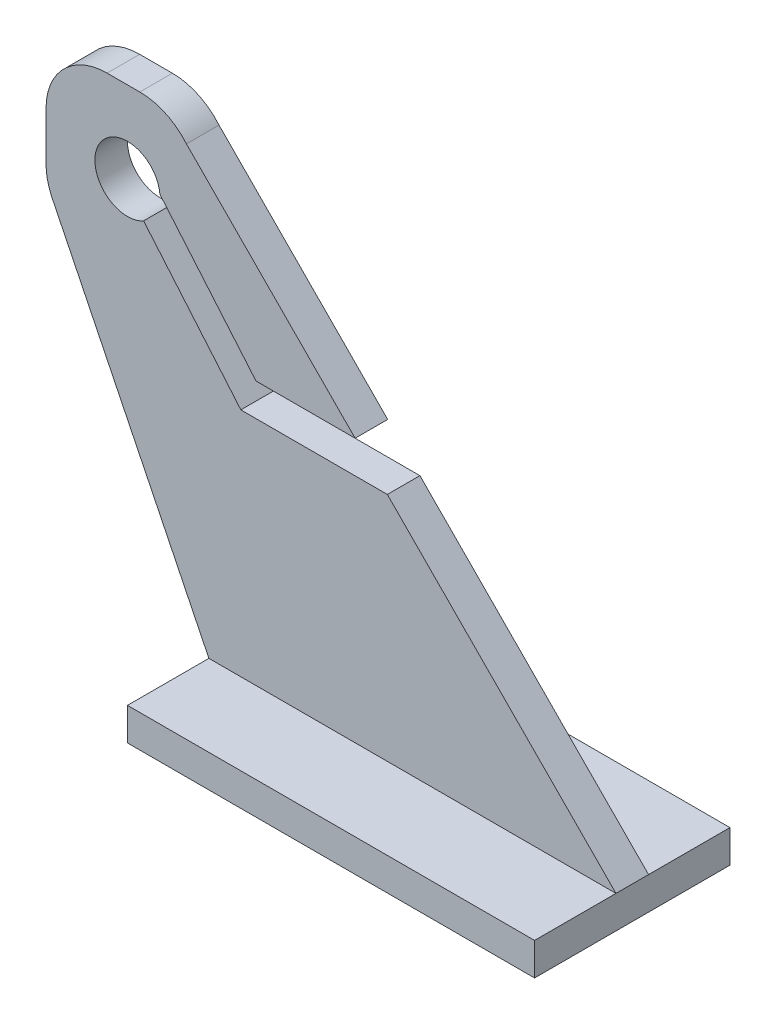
ISO-10303-21;
HEADER;
FILE_DESCRIPTION(('STEP AP214'),'2;1');
FILE_NAME('part.step','',(''),(''),'','','');
FILE_SCHEMA(('AUTOMOTIVE_DESIGN { 1 0 10303 214 1 1 1 1 }'));
ENDSEC;
DATA;
#1=APPLICATION_CONTEXT('core data for automotive mechanical design processes');
#2=APPLICATION_PROTOCOL_DEFINITION('international standard','automotive_design',2000,#1);
#3=PRODUCT_CONTEXT('',#1,'mechanical');
#4=PRODUCT('Part','Part','',(#3));
#5=PRODUCT_RELATED_PRODUCT_CATEGORY('part','',(#4));
#6=PRODUCT_DEFINITION_FORMATION('','',#4);
#7=PRODUCT_DEFINITION_CONTEXT('part definition',#1,'design');
#8=PRODUCT_DEFINITION('design','',#6,#7);
#9=PRODUCT_DEFINITION_SHAPE('','',#8);
#10=(LENGTH_UNIT() NAMED_UNIT(*) SI_UNIT(.MILLI.,.METRE.));
#11=(NAMED_UNIT(*) PLANE_ANGLE_UNIT() SI_UNIT($,.RADIAN.));
#12=(NAMED_UNIT(*) SI_UNIT($,.STERADIAN.) SOLID_ANGLE_UNIT());
#13=UNCERTAINTY_MEASURE_WITH_UNIT(LENGTH_MEASURE(1.E-05),#10,'distance_accuracy_value','');
#14=(GEOMETRIC_REPRESENTATION_CONTEXT(3) GLOBAL_UNCERTAINTY_ASSIGNED_CONTEXT((#13)) GLOBAL_UNIT_ASSIGNED_CONTEXT((#10,
#11,#12)) REPRESENTATION_CONTEXT('',''));
#15=CARTESIAN_POINT('',(0.,0.,0.));
#16=DIRECTION('',(0.,0.,1.));
#17=DIRECTION('',(1.,0.,0.));
#18=AXIS2_PLACEMENT_3D('',#15,#16,#17);
#19=CARTESIAN_POINT('',(4.44941706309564,11.4681898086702,0.8));
#20=DIRECTION('',(-0.71101506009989,-0.703176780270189,0.));
#21=DIRECTION('',(0.703176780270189,-0.71101506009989,0.));
#22=AXIS2_PLACEMENT_3D('',#19,#20,#21);
#23=PLANE('',#22);
#24=DIRECTION('',(-0.703176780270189,0.71101506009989,0.));
#25=VECTOR('',#24,1.);
#26=CARTESIAN_POINT('',(4.44941706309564,11.4681898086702,0.8));
#27=LINE('',#26,#25);
#28=CARTESIAN_POINT('',(8.59261820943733,7.27880458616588,0.8));
#29=VERTEX_POINT('',#28);
#30=CARTESIAN_POINT('',(4.44941706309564,11.4681898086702,0.8));
#31=VERTEX_POINT('',#30);
#32=EDGE_CURVE('E272',#29,#31,#27,.T.);
#33=ORIENTED_EDGE('',*,*,#32,.F.);
#34=DIRECTION('',(0.,0.,-1.));
#35=VECTOR('',#34,1.);
#36=CARTESIAN_POINT('',(8.59261820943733,7.27880458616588,0.8));
#37=LINE('',#36,#35);
#38=CARTESIAN_POINT('',(8.59261820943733,7.27880458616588,0.));
#39=VERTEX_POINT('',#38);
#40=EDGE_CURVE('E11',#29,#39,#37,.T.);
#41=ORIENTED_EDGE('',*,*,#40,.T.);
#42=DIRECTION('',(-0.703176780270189,0.71101506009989,0.));
#43=VECTOR('',#42,1.);
#44=CARTESIAN_POINT('',(4.44941706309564,11.4681898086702,0.));
#45=LINE('',#44,#43);
#46=CARTESIAN_POINT('',(4.44941706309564,11.4681898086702,0.));
#47=VERTEX_POINT('',#46);
#48=EDGE_CURVE('E295',#39,#47,#45,.T.);
#49=ORIENTED_EDGE('',*,*,#48,.T.);
#50=DIRECTION('',(0.,0.,-1.));
#51=VECTOR('',#50,1.);
#52=CARTESIAN_POINT('',(4.44941706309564,11.4681898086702,0.8));
#53=LINE('',#52,#51);
#54=EDGE_CURVE('E326',#31,#47,#53,.T.);
#55=ORIENTED_EDGE('',*,*,#54,.F.);
#56=EDGE_LOOP('',(#33,#41,#49,#55));
#57=FACE_BOUND('',#56,.T.);
#58=ADVANCED_FACE('F39',(#57),#23,.F.);
#59=CARTESIAN_POINT('',(2.5,9.31961954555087,0.8));
#60=DIRECTION('',(0.,0.,-1.));
#61=DIRECTION('',(-1.,0.,0.));
#62=AXIS2_PLACEMENT_3D('',#59,#60,#61);
#63=PLANE('',#62);
#64=CARTESIAN_POINT('',(3.,10.,0.8));
#65=DIRECTION('',(0.,0.,1.));
#66=DIRECTION('',(1.,0.,0.));
#67=AXIS2_PLACEMENT_3D('',#64,#65,#66);
#68=CIRCLE('',#67,0.8);
#69=CARTESIAN_POINT('',(3.7968170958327,10.071291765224,0.8));
#70=VERTEX_POINT('',#69);
#71=CARTESIAN_POINT('',(3.39672986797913,9.30530192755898,0.8));
#72=VERTEX_POINT('',#71);
#73=EDGE_CURVE('E257',#70,#72,#68,.T.);
#74=ORIENTED_EDGE('',*,*,#73,.F.);
#75=DIRECTION('',(-0.645459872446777,0.763794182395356,0.));
#76=VECTOR('',#75,1.);
#77=CARTESIAN_POINT('',(3.66776309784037,10.2240056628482,0.8));
#78=LINE('',#77,#76);
#79=CARTESIAN_POINT('',(6.15666541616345,7.27880458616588,0.8));
#80=VERTEX_POINT('',#79);
#81=EDGE_CURVE('E63',#80,#70,#78,.T.);
#82=ORIENTED_EDGE('',*,*,#81,.F.);
#83=DIRECTION('',(-1.,0.,0.));
#84=VECTOR('',#83,1.);
#85=CARTESIAN_POINT('',(6.15666541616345,7.27880458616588,0.8));
#86=LINE('',#85,#84);
#87=EDGE_CURVE('E189',#29,#80,#86,.T.);
#88=ORIENTED_EDGE('',*,*,#87,.F.);
#89=ORIENTED_EDGE('',*,*,#32,.T.);
#90=CARTESIAN_POINT('',(3.3037257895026,10.5,0.8));
#91=DIRECTION('',(0.,0.,1.));
#92=DIRECTION('',(1.,0.,0.));
#93=AXIS2_PLACEMENT_3D('',#90,#91,#92);
#94=CIRCLE('',#93,1.5);
#95=CARTESIAN_POINT('',(3.3037257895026,12.,0.8));
#96=VERTEX_POINT('',#95);
#97=EDGE_CURVE('E275',#31,#96,#94,.T.);
#98=ORIENTED_EDGE('',*,*,#97,.T.);
#99=DIRECTION('',(-1.,0.,0.));
#100=VECTOR('',#99,1.);
#101=CARTESIAN_POINT('',(2.50000000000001,12.,0.8));
#102=LINE('',#101,#100);
#103=CARTESIAN_POINT('',(2.50000000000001,12.,0.8));
#104=VERTEX_POINT('',#103);
#105=EDGE_CURVE('E278',#96,#104,#102,.T.);
#106=ORIENTED_EDGE('',*,*,#105,.T.);
#107=CARTESIAN_POINT('',(2.5,10.5,0.8));
#108=DIRECTION('',(0.,0.,1.));
#109=DIRECTION('',(-1.,0.,0.));
#110=AXIS2_PLACEMENT_3D('',#107,#108,#109);
#111=CIRCLE('',#110,1.5);
#112=CARTESIAN_POINT('',(1.,10.5,0.8));
#113=VERTEX_POINT('',#112);
#114=EDGE_CURVE('E281',#104,#113,#111,.T.);
#115=ORIENTED_EDGE('',*,*,#114,.T.);
#116=DIRECTION('',(0.,-1.,0.));
#117=VECTOR('',#116,1.);
#118=CARTESIAN_POINT('',(1.,9.31961954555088,0.8));
#119=LINE('',#118,#117);
#120=CARTESIAN_POINT('',(1.,9.31961954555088,0.8));
#121=VERTEX_POINT('',#120);
#122=EDGE_CURVE('E284',#113,#121,#119,.T.);
#123=ORIENTED_EDGE('',*,*,#122,.T.);
#124=CARTESIAN_POINT('',(2.5,9.31961954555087,0.8));
#125=DIRECTION('',(0.,0.,1.));
#126=DIRECTION('',(-1.,0.,0.));
#127=AXIS2_PLACEMENT_3D('',#124,#125,#126);
#128=CIRCLE('',#127,1.5);
#129=CARTESIAN_POINT('',(1.13029317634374,8.70814328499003,0.8));
#130=VERTEX_POINT('',#129);
#131=EDGE_CURVE('E264',#121,#130,#128,.T.);
#132=ORIENTED_EDGE('',*,*,#131,.T.);
#133=DIRECTION('',(0.439531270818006,-0.898227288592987,0.));
#134=VECTOR('',#133,1.);
#135=CARTESIAN_POINT('',(5.,0.8,0.8));
#136=LINE('',#135,#134);
#137=CARTESIAN_POINT('',(5.,0.8,0.8));
#138=VERTEX_POINT('',#137);
#139=EDGE_CURVE('E268',#130,#138,#136,.T.);
#140=ORIENTED_EDGE('',*,*,#139,.T.);
#141=DIRECTION('',(1.,0.,0.));
#142=VECTOR('',#141,1.);
#143=CARTESIAN_POINT('',(2.5,0.8,0.8));
#144=LINE('',#143,#142);
#145=CARTESIAN_POINT('',(15.,0.8,0.8));
#146=VERTEX_POINT('',#145);
#147=EDGE_CURVE('E253',#138,#146,#144,.T.);
#148=ORIENTED_EDGE('',*,*,#147,.T.);
#149=CARTESIAN_POINT('',(9.3837989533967,6.47880458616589,0.8));
#150=VERTEX_POINT('',#149);
#151=EDGE_CURVE('E187',#146,#150,#27,.T.);
#152=ORIENTED_EDGE('',*,*,#151,.T.);
#153=DIRECTION('',(1.,0.,0.));
#154=VECTOR('',#153,1.);
#155=CARTESIAN_POINT('',(5.78531917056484,6.47880458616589,0.8));
#156=LINE('',#155,#154);
#157=CARTESIAN_POINT('',(5.78531917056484,6.47880458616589,0.8));
#158=VERTEX_POINT('',#157);
#159=EDGE_CURVE('E168',#158,#150,#156,.T.);
#160=ORIENTED_EDGE('',*,*,#159,.F.);
#161=DIRECTION('',(0.645459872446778,-0.763794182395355,0.));
#162=VECTOR('',#161,1.);
#163=CARTESIAN_POINT('',(3.05672775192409,9.70763776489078,0.8));
#164=LINE('',#163,#162);
#165=EDGE_CURVE('E176',#72,#158,#164,.T.);
#166=ORIENTED_EDGE('',*,*,#165,.F.);
#167=EDGE_LOOP('',(#74,#82,#88,#89,#98,#106,#115,#123,#132,#140,#148,#152,#160,#166));
#168=FACE_BOUND('',#167,.T.);
#169=ADVANCED_FACE('F185',(#168),#63,.F.);
#170=CARTESIAN_POINT('',(2.5,9.31961954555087,0.));
#171=DIRECTION('',(0.,0.,-1.));
#172=DIRECTION('',(-1.,0.,0.));
#173=AXIS2_PLACEMENT_3D('',#170,#171,#172);
#174=PLANE('',#173);
#175=DIRECTION('',(0.645459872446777,-0.763794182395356,0.));
#176=VECTOR('',#175,1.);
#177=CARTESIAN_POINT('',(3.62711244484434,10.2721089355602,0.));
#178=LINE('',#177,#176);
#179=CARTESIAN_POINT('',(3.7968170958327,10.071291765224,0.));
#180=VERTEX_POINT('',#179);
#181=CARTESIAN_POINT('',(6.15666541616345,7.27880458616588,0.));
#182=VERTEX_POINT('',#181);
#183=EDGE_CURVE('E201',#180,#182,#178,.T.);
#184=ORIENTED_EDGE('',*,*,#183,.F.);
#185=CARTESIAN_POINT('',(3.,10.,0.));
#186=DIRECTION('',(0.,0.,1.));
#187=DIRECTION('',(1.,0.,0.));
#188=AXIS2_PLACEMENT_3D('',#185,#186,#187);
#189=CIRCLE('',#188,0.8);
#190=CARTESIAN_POINT('',(3.39672986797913,9.30530192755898,0.));
#191=VERTEX_POINT('',#190);
#192=EDGE_CURVE('E256',#180,#191,#189,.T.);
#193=ORIENTED_EDGE('',*,*,#192,.T.);
#194=DIRECTION('',(-0.645459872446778,0.763794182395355,0.));
#195=VECTOR('',#194,1.);
#196=CARTESIAN_POINT('',(3.01607709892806,9.75574103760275,0.));
#197=LINE('',#196,#195);
#198=CARTESIAN_POINT('',(5.78531917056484,6.47880458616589,0.));
#199=VERTEX_POINT('',#198);
#200=EDGE_CURVE('E55',#199,#191,#197,.T.);
#201=ORIENTED_EDGE('',*,*,#200,.F.);
#202=DIRECTION('',(-1.,0.,0.));
#203=VECTOR('',#202,1.);
#204=CARTESIAN_POINT('',(2.5,6.47880458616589,0.));
#205=LINE('',#204,#203);
#206=CARTESIAN_POINT('',(9.3837989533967,6.47880458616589,0.));
#207=VERTEX_POINT('',#206);
#208=EDGE_CURVE('E171',#207,#199,#205,.T.);
#209=ORIENTED_EDGE('',*,*,#208,.F.);
#210=CARTESIAN_POINT('',(15.,0.8,0.));
#211=VERTEX_POINT('',#210);
#212=EDGE_CURVE('E296',#211,#207,#45,.T.);
#213=ORIENTED_EDGE('',*,*,#212,.F.);
#214=DIRECTION('',(1.,0.,0.));
#215=VECTOR('',#214,1.);
#216=CARTESIAN_POINT('',(2.5,0.8,0.));
#217=LINE('',#216,#215);
#218=CARTESIAN_POINT('',(5.,0.8,0.));
#219=VERTEX_POINT('',#218);
#220=EDGE_CURVE('E245',#219,#211,#217,.T.);
#221=ORIENTED_EDGE('',*,*,#220,.F.);
#222=DIRECTION('',(0.439531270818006,-0.898227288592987,0.));
#223=VECTOR('',#222,1.);
#224=CARTESIAN_POINT('',(5.,0.8,0.));
#225=LINE('',#224,#223);
#226=CARTESIAN_POINT('',(1.13029317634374,8.70814328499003,0.));
#227=VERTEX_POINT('',#226);
#228=EDGE_CURVE('E291',#227,#219,#225,.T.);
#229=ORIENTED_EDGE('',*,*,#228,.F.);
#230=CARTESIAN_POINT('',(2.5,9.31961954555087,0.));
#231=DIRECTION('',(0.,0.,1.));
#232=DIRECTION('',(-1.,0.,0.));
#233=AXIS2_PLACEMENT_3D('',#230,#231,#232);
#234=CIRCLE('',#233,1.5);
#235=CARTESIAN_POINT('',(1.,9.31961954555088,0.));
#236=VERTEX_POINT('',#235);
#237=EDGE_CURVE('E260',#236,#227,#234,.T.);
#238=ORIENTED_EDGE('',*,*,#237,.F.);
#239=DIRECTION('',(0.,-1.,0.));
#240=VECTOR('',#239,1.);
#241=CARTESIAN_POINT('',(1.,9.31961954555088,0.));
#242=LINE('',#241,#240);
#243=CARTESIAN_POINT('',(1.,10.5,0.));
#244=VERTEX_POINT('',#243);
#245=EDGE_CURVE('E269',#244,#236,#242,.T.);
#246=ORIENTED_EDGE('',*,*,#245,.F.);
#247=CARTESIAN_POINT('',(2.5,10.5,0.));
#248=DIRECTION('',(0.,0.,1.));
#249=DIRECTION('',(-1.,0.,0.));
#250=AXIS2_PLACEMENT_3D('',#247,#248,#249);
#251=CIRCLE('',#250,1.5);
#252=CARTESIAN_POINT('',(2.50000000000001,12.,0.));
#253=VERTEX_POINT('',#252);
#254=EDGE_CURVE('E306',#253,#244,#251,.T.);
#255=ORIENTED_EDGE('',*,*,#254,.F.);
#256=DIRECTION('',(-1.,0.,0.));
#257=VECTOR('',#256,1.);
#258=CARTESIAN_POINT('',(2.50000000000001,12.,0.));
#259=LINE('',#258,#257);
#260=CARTESIAN_POINT('',(3.3037257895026,12.,0.));
#261=VERTEX_POINT('',#260);
#262=EDGE_CURVE('E303',#261,#253,#259,.T.);
#263=ORIENTED_EDGE('',*,*,#262,.F.);
#264=CARTESIAN_POINT('',(3.3037257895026,10.5,0.));
#265=DIRECTION('',(0.,0.,1.));
#266=DIRECTION('',(1.,0.,0.));
#267=AXIS2_PLACEMENT_3D('',#264,#265,#266);
#268=CIRCLE('',#267,1.5);
#269=EDGE_CURVE('E300',#47,#261,#268,.T.);
#270=ORIENTED_EDGE('',*,*,#269,.F.);
#271=ORIENTED_EDGE('',*,*,#48,.F.);
#272=DIRECTION('',(1.,0.,0.));
#273=VECTOR('',#272,1.);
#274=CARTESIAN_POINT('',(2.5,7.27880458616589,0.));
#275=LINE('',#274,#273);
#276=EDGE_CURVE('E206',#182,#39,#275,.T.);
#277=ORIENTED_EDGE('',*,*,#276,.F.);
#278=EDGE_LOOP('',(#184,#193,#201,#209,#213,#221,#229,#238,#246,#255,#263,#270,#271,#277));
#279=FACE_BOUND('',#278,.T.);
#280=ADVANCED_FACE('F359',(#279),#174,.T.);
#281=CARTESIAN_POINT('',(2.5,9.31961954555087,0.8));
#282=DIRECTION('',(0.,0.,-1.));
#283=DIRECTION('',(-1.,0.,0.));
#284=AXIS2_PLACEMENT_3D('',#281,#282,#283);
#285=CYLINDRICAL_SURFACE('',#284,1.5);
#286=ORIENTED_EDGE('',*,*,#237,.T.);
#287=DIRECTION('',(0.,0.,-1.));
#288=VECTOR('',#287,1.);
#289=CARTESIAN_POINT('',(1.13029317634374,8.70814328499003,0.8));
#290=LINE('',#289,#288);
#291=EDGE_CURVE('E344',#130,#227,#290,.T.);
#292=ORIENTED_EDGE('',*,*,#291,.F.);
#293=ORIENTED_EDGE('',*,*,#131,.F.);
#294=DIRECTION('',(0.,0.,-1.));
#295=VECTOR('',#294,1.);
#296=CARTESIAN_POINT('',(1.,9.31961954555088,0.8));
#297=LINE('',#296,#295);
#298=EDGE_CURVE('E287',#121,#236,#297,.T.);
#299=ORIENTED_EDGE('',*,*,#298,.T.);
#300=EDGE_LOOP('',(#286,#292,#293,#299));
#301=FACE_BOUND('',#300,.T.);
#302=ADVANCED_FACE('F41',(#301),#285,.T.);
#303=CARTESIAN_POINT('',(5.,0.8,0.8));
#304=DIRECTION('',(0.898227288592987,0.439531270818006,0.));
#305=DIRECTION('',(-0.439531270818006,0.898227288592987,0.));
#306=AXIS2_PLACEMENT_3D('',#303,#304,#305);
#307=PLANE('',#306);
#308=ORIENTED_EDGE('',*,*,#228,.T.);
#309=DIRECTION('',(0.,0.,-1.));
#310=VECTOR('',#309,1.);
#311=CARTESIAN_POINT('',(5.,0.8,0.8));
#312=LINE('',#311,#310);
#313=EDGE_CURVE('E340',#138,#219,#312,.T.);
#314=ORIENTED_EDGE('',*,*,#313,.F.);
#315=ORIENTED_EDGE('',*,*,#139,.F.);
#316=ORIENTED_EDGE('',*,*,#291,.T.);
#317=EDGE_LOOP('',(#308,#314,#315,#316));
#318=FACE_BOUND('',#317,.T.);
#319=ADVANCED_FACE('F405',(#318),#307,.F.);
#320=CARTESIAN_POINT('',(5.,0.,0.8));
#321=DIRECTION('',(1.,0.,0.));
#322=DIRECTION('',(0.,0.,-1.));
#323=AXIS2_PLACEMENT_3D('',#320,#321,#322);
#324=PLANE('',#323);
#325=ORIENTED_EDGE('',*,*,#313,.T.);
#326=DIRECTION('',(0.,0.,1.));
#327=VECTOR('',#326,1.);
#328=CARTESIAN_POINT('',(5.,0.8,-2.));
#329=LINE('',#328,#327);
#330=CARTESIAN_POINT('',(5.,0.8,-2.));
#331=VERTEX_POINT('',#330);
#332=EDGE_CURVE('E242',#331,#219,#329,.T.);
#333=ORIENTED_EDGE('',*,*,#332,.F.);
#334=DIRECTION('',(0.,-1.,0.));
#335=VECTOR('',#334,1.);
#336=CARTESIAN_POINT('',(5.,0.,-2.));
#337=LINE('',#336,#335);
#338=CARTESIAN_POINT('',(5.,0.,-2.));
#339=VERTEX_POINT('',#338);
#340=EDGE_CURVE('E225',#331,#339,#337,.T.);
#341=ORIENTED_EDGE('',*,*,#340,.T.);
#342=DIRECTION('',(0.,0.,-1.));
#343=VECTOR('',#342,1.);
#344=CARTESIAN_POINT('',(5.,0.,0.8));
#345=LINE('',#344,#343);
#346=CARTESIAN_POINT('',(5.,0.,2.8));
#347=VERTEX_POINT('',#346);
#348=EDGE_CURVE('E337',#347,#339,#345,.T.);
#349=ORIENTED_EDGE('',*,*,#348,.F.);
#350=DIRECTION('',(0.,-1.,0.));
#351=VECTOR('',#350,1.);
#352=CARTESIAN_POINT('',(5.,0.,2.8));
#353=LINE('',#352,#351);
#354=CARTESIAN_POINT('',(5.,0.8,2.8));
#355=VERTEX_POINT('',#354);
#356=EDGE_CURVE('E209',#355,#347,#353,.T.);
#357=ORIENTED_EDGE('',*,*,#356,.F.);
#358=EDGE_CURVE('E246',#138,#355,#329,.T.);
#359=ORIENTED_EDGE('',*,*,#358,.F.);
#360=EDGE_LOOP('',(#325,#333,#341,#349,#357,#359));
#361=FACE_BOUND('',#360,.T.);
#362=ADVANCED_FACE('F391',(#361),#324,.F.);
#363=CARTESIAN_POINT('',(5.,0.,0.8));
#364=DIRECTION('',(0.,1.,0.));
#365=DIRECTION('',(0.,0.,1.));
#366=AXIS2_PLACEMENT_3D('',#363,#364,#365);
#367=PLANE('',#366);
#368=ORIENTED_EDGE('',*,*,#348,.T.);
#369=DIRECTION('',(1.,0.,0.));
#370=VECTOR('',#369,1.);
#371=CARTESIAN_POINT('',(5.,0.,-2.));
#372=LINE('',#371,#370);
#373=CARTESIAN_POINT('',(15.,0.,-2.));
#374=VERTEX_POINT('',#373);
#375=EDGE_CURVE('E229',#339,#374,#372,.T.);
#376=ORIENTED_EDGE('',*,*,#375,.T.);
#377=DIRECTION('',(0.,0.,-1.));
#378=VECTOR('',#377,1.);
#379=CARTESIAN_POINT('',(15.,0.,0.8));
#380=LINE('',#379,#378);
#381=CARTESIAN_POINT('',(15.,0.,2.8));
#382=VERTEX_POINT('',#381);
#383=EDGE_CURVE('E334',#382,#374,#380,.T.);
#384=ORIENTED_EDGE('',*,*,#383,.F.);
#385=DIRECTION('',(1.,0.,0.));
#386=VECTOR('',#385,1.);
#387=CARTESIAN_POINT('',(5.,0.,2.8));
#388=LINE('',#387,#386);
#389=EDGE_CURVE('E213',#347,#382,#388,.T.);
#390=ORIENTED_EDGE('',*,*,#389,.F.);
#391=EDGE_LOOP('',(#368,#376,#384,#390));
#392=FACE_BOUND('',#391,.T.);
#393=ADVANCED_FACE('F396',(#392),#367,.F.);
#394=CARTESIAN_POINT('',(15.,0.8,0.8));
#395=DIRECTION('',(-1.,0.,0.));
#396=DIRECTION('',(0.,0.,1.));
#397=AXIS2_PLACEMENT_3D('',#394,#395,#396);
#398=PLANE('',#397);
#399=ORIENTED_EDGE('',*,*,#383,.T.);
#400=DIRECTION('',(0.,1.,0.));
#401=VECTOR('',#400,1.);
#402=CARTESIAN_POINT('',(15.,0.,-2.));
#403=LINE('',#402,#401);
#404=CARTESIAN_POINT('',(15.,0.8,-2.));
#405=VERTEX_POINT('',#404);
#406=EDGE_CURVE('E233',#374,#405,#403,.T.);
#407=ORIENTED_EDGE('',*,*,#406,.T.);
#408=DIRECTION('',(0.,0.,1.));
#409=VECTOR('',#408,1.);
#410=CARTESIAN_POINT('',(15.,0.8,-2.));
#411=LINE('',#410,#409);
#412=EDGE_CURVE('E247',#405,#211,#411,.T.);
#413=ORIENTED_EDGE('',*,*,#412,.T.);
#414=DIRECTION('',(0.,0.,-1.));
#415=VECTOR('',#414,1.);
#416=CARTESIAN_POINT('',(15.,0.8,0.8));
#417=LINE('',#416,#415);
#418=EDGE_CURVE('E330',#146,#211,#417,.T.);
#419=ORIENTED_EDGE('',*,*,#418,.F.);
#420=CARTESIAN_POINT('',(15.,0.8,2.8));
#421=VERTEX_POINT('',#420);
#422=EDGE_CURVE('E241',#146,#421,#411,.T.);
#423=ORIENTED_EDGE('',*,*,#422,.T.);
#424=DIRECTION('',(0.,1.,0.));
#425=VECTOR('',#424,1.);
#426=CARTESIAN_POINT('',(15.,0.,2.8));
#427=LINE('',#426,#425);
#428=EDGE_CURVE('E217',#382,#421,#427,.T.);
#429=ORIENTED_EDGE('',*,*,#428,.F.);
#430=EDGE_LOOP('',(#399,#407,#413,#419,#423,#429));
#431=FACE_BOUND('',#430,.T.);
#432=ADVANCED_FACE('F380',(#431),#398,.F.);
#433=ORIENTED_EDGE('',*,*,#212,.T.);
#434=DIRECTION('',(0.,0.,1.));
#435=VECTOR('',#434,1.);
#436=CARTESIAN_POINT('',(9.3837989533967,6.47880458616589,0.8));
#437=LINE('',#436,#435);
#438=EDGE_CURVE('E48',#207,#150,#437,.T.);
#439=ORIENTED_EDGE('',*,*,#438,.T.);
#440=ORIENTED_EDGE('',*,*,#151,.F.);
#441=ORIENTED_EDGE('',*,*,#418,.T.);
#442=EDGE_LOOP('',(#433,#439,#440,#441));
#443=FACE_BOUND('',#442,.T.);
#444=ADVANCED_FACE('F354',(#443),#23,.F.);
#445=CARTESIAN_POINT('',(3.3037257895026,10.5,0.8));
#446=DIRECTION('',(0.,0.,-1.));
#447=DIRECTION('',(-1.,0.,0.));
#448=AXIS2_PLACEMENT_3D('',#445,#446,#447);
#449=CYLINDRICAL_SURFACE('',#448,1.5);
#450=ORIENTED_EDGE('',*,*,#269,.T.);
#451=DIRECTION('',(0.,0.,-1.));
#452=VECTOR('',#451,1.);
#453=CARTESIAN_POINT('',(3.3037257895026,12.,0.8));
#454=LINE('',#453,#452);
#455=EDGE_CURVE('E322',#96,#261,#454,.T.);
#456=ORIENTED_EDGE('',*,*,#455,.F.);
#457=ORIENTED_EDGE('',*,*,#97,.F.);
#458=ORIENTED_EDGE('',*,*,#54,.T.);
#459=EDGE_LOOP('',(#450,#456,#457,#458));
#460=FACE_BOUND('',#459,.T.);
#461=ADVANCED_FACE('F427',(#460),#449,.T.);
#462=CARTESIAN_POINT('',(2.50000000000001,12.,0.8));
#463=DIRECTION('',(0.,-1.,0.));
#464=DIRECTION('',(0.,0.,-1.));
#465=AXIS2_PLACEMENT_3D('',#462,#463,#464);
#466=PLANE('',#465);
#467=ORIENTED_EDGE('',*,*,#262,.T.);
#468=DIRECTION('',(0.,0.,-1.));
#469=VECTOR('',#468,1.);
#470=CARTESIAN_POINT('',(2.50000000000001,12.,0.8));
#471=LINE('',#470,#469);
#472=EDGE_CURVE('E318',#104,#253,#471,.T.);
#473=ORIENTED_EDGE('',*,*,#472,.F.);
#474=ORIENTED_EDGE('',*,*,#105,.F.);
#475=ORIENTED_EDGE('',*,*,#455,.T.);
#476=EDGE_LOOP('',(#467,#473,#474,#475));
#477=FACE_BOUND('',#476,.T.);
#478=ADVANCED_FACE('F423',(#477),#466,.F.);
#479=CARTESIAN_POINT('',(2.5,10.5,0.8));
#480=DIRECTION('',(0.,0.,-1.));
#481=DIRECTION('',(-1.,0.,0.));
#482=AXIS2_PLACEMENT_3D('',#479,#480,#481);
#483=CYLINDRICAL_SURFACE('',#482,1.5);
#484=ORIENTED_EDGE('',*,*,#254,.T.);
#485=DIRECTION('',(0.,0.,-1.));
#486=VECTOR('',#485,1.);
#487=CARTESIAN_POINT('',(1.,10.5,0.8));
#488=LINE('',#487,#486);
#489=EDGE_CURVE('E314',#113,#244,#488,.T.);
#490=ORIENTED_EDGE('',*,*,#489,.F.);
#491=ORIENTED_EDGE('',*,*,#114,.F.);
#492=ORIENTED_EDGE('',*,*,#472,.T.);
#493=EDGE_LOOP('',(#484,#490,#491,#492));
#494=FACE_BOUND('',#493,.T.);
#495=ADVANCED_FACE('F419',(#494),#483,.T.);
#496=CARTESIAN_POINT('',(1.,9.31961954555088,0.8));
#497=DIRECTION('',(1.,0.,0.));
#498=DIRECTION('',(0.,0.,-1.));
#499=AXIS2_PLACEMENT_3D('',#496,#497,#498);
#500=PLANE('',#499);
#501=ORIENTED_EDGE('',*,*,#245,.T.);
#502=ORIENTED_EDGE('',*,*,#298,.F.);
#503=ORIENTED_EDGE('',*,*,#122,.F.);
#504=ORIENTED_EDGE('',*,*,#489,.T.);
#505=EDGE_LOOP('',(#501,#502,#503,#504));
#506=FACE_BOUND('',#505,.T.);
#507=ADVANCED_FACE('F414',(#506),#500,.F.);
#508=CARTESIAN_POINT('',(3.,10.,0.8));
#509=DIRECTION('',(0.,0.,-1.));
#510=DIRECTION('',(-1.,0.,0.));
#511=AXIS2_PLACEMENT_3D('',#508,#509,#510);
#512=CYLINDRICAL_SURFACE('',#511,0.8);
#513=DIRECTION('',(0.,0.,-1.));
#514=VECTOR('',#513,1.);
#515=CARTESIAN_POINT('',(3.7968170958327,10.071291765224,0.8));
#516=LINE('',#515,#514);
#517=EDGE_CURVE('E350',#70,#180,#516,.T.);
#518=ORIENTED_EDGE('',*,*,#517,.F.);
#519=ORIENTED_EDGE('',*,*,#73,.T.);
#520=DIRECTION('',(0.,0.,-1.));
#521=VECTOR('',#520,1.);
#522=CARTESIAN_POINT('',(3.39672986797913,9.30530192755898,0.8));
#523=LINE('',#522,#521);
#524=EDGE_CURVE('E178',#191,#72,#523,.F.);
#525=ORIENTED_EDGE('',*,*,#524,.F.);
#526=ORIENTED_EDGE('',*,*,#192,.F.);
#527=EDGE_LOOP('',(#518,#519,#525,#526));
#528=FACE_BOUND('',#527,.T.);
#529=ADVANCED_FACE('F364',(#528),#512,.F.);
#530=CARTESIAN_POINT('',(0.,0.,-2.));
#531=DIRECTION('',(0.,0.,-1.));
#532=DIRECTION('',(-1.,0.,0.));
#533=AXIS2_PLACEMENT_3D('',#530,#531,#532);
#534=PLANE('',#533);
#535=ORIENTED_EDGE('',*,*,#340,.F.);
#536=DIRECTION('',(-1.,0.,0.));
#537=VECTOR('',#536,1.);
#538=CARTESIAN_POINT('',(5.,0.8,-2.));
#539=LINE('',#538,#537);
#540=EDGE_CURVE('E237',#405,#331,#539,.T.);
#541=ORIENTED_EDGE('',*,*,#540,.F.);
#542=ORIENTED_EDGE('',*,*,#406,.F.);
#543=ORIENTED_EDGE('',*,*,#375,.F.);
#544=EDGE_LOOP('',(#535,#541,#542,#543));
#545=FACE_BOUND('',#544,.T.);
#546=ADVANCED_FACE('F400',(#545),#534,.T.);
#547=CARTESIAN_POINT('',(5.,0.8,-2.));
#548=DIRECTION('',(0.,1.,0.));
#549=DIRECTION('',(0.,0.,1.));
#550=AXIS2_PLACEMENT_3D('',#547,#548,#549);
#551=PLANE('',#550);
#552=ORIENTED_EDGE('',*,*,#332,.T.);
#553=ORIENTED_EDGE('',*,*,#220,.T.);
#554=ORIENTED_EDGE('',*,*,#412,.F.);
#555=ORIENTED_EDGE('',*,*,#540,.T.);
#556=EDGE_LOOP('',(#552,#553,#554,#555));
#557=FACE_BOUND('',#556,.T.);
#558=ADVANCED_FACE('F402',(#557),#551,.T.);
#559=ORIENTED_EDGE('',*,*,#147,.F.);
#560=ORIENTED_EDGE('',*,*,#358,.T.);
#561=DIRECTION('',(-1.,0.,0.));
#562=VECTOR('',#561,1.);
#563=CARTESIAN_POINT('',(5.,0.8,2.8));
#564=LINE('',#563,#562);
#565=EDGE_CURVE('E221',#421,#355,#564,.T.);
#566=ORIENTED_EDGE('',*,*,#565,.F.);
#567=ORIENTED_EDGE('',*,*,#422,.F.);
#568=EDGE_LOOP('',(#559,#560,#566,#567));
#569=FACE_BOUND('',#568,.T.);
#570=ADVANCED_FACE('F388',(#569),#551,.T.);
#571=CARTESIAN_POINT('',(0.,0.,2.8));
#572=DIRECTION('',(0.,0.,-1.));
#573=DIRECTION('',(-1.,0.,0.));
#574=AXIS2_PLACEMENT_3D('',#571,#572,#573);
#575=PLANE('',#574);
#576=ORIENTED_EDGE('',*,*,#356,.T.);
#577=ORIENTED_EDGE('',*,*,#389,.T.);
#578=ORIENTED_EDGE('',*,*,#428,.T.);
#579=ORIENTED_EDGE('',*,*,#565,.T.);
#580=EDGE_LOOP('',(#576,#577,#578,#579));
#581=FACE_BOUND('',#580,.T.);
#582=ADVANCED_FACE('F385',(#581),#575,.F.);
#583=CARTESIAN_POINT('',(3.05672775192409,9.70763776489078,-2.));
#584=DIRECTION('',(-0.763794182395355,-0.645459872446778,0.));
#585=DIRECTION('',(0.645459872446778,-0.763794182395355,0.));
#586=AXIS2_PLACEMENT_3D('',#583,#584,#585);
#587=PLANE('',#586);
#588=ORIENTED_EDGE('',*,*,#200,.T.);
#589=ORIENTED_EDGE('',*,*,#524,.T.);
#590=ORIENTED_EDGE('',*,*,#165,.T.);
#591=DIRECTION('',(0.,0.,1.));
#592=VECTOR('',#591,1.);
#593=CARTESIAN_POINT('',(5.78531917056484,6.47880458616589,-2.));
#594=LINE('',#593,#592);
#595=EDGE_CURVE('E164',#199,#158,#594,.T.);
#596=ORIENTED_EDGE('',*,*,#595,.F.);
#597=EDGE_LOOP('',(#588,#589,#590,#596));
#598=FACE_BOUND('',#597,.T.);
#599=ADVANCED_FACE('F177',(#598),#587,.F.);
#600=CARTESIAN_POINT('',(5.78531917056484,6.47880458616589,-2.));
#601=DIRECTION('',(0.,-1.,0.));
#602=DIRECTION('',(0.,0.,-1.));
#603=AXIS2_PLACEMENT_3D('',#600,#601,#602);
#604=PLANE('',#603);
#605=ORIENTED_EDGE('',*,*,#208,.T.);
#606=ORIENTED_EDGE('',*,*,#595,.T.);
#607=ORIENTED_EDGE('',*,*,#159,.T.);
#608=ORIENTED_EDGE('',*,*,#438,.F.);
#609=EDGE_LOOP('',(#605,#606,#607,#608));
#610=FACE_BOUND('',#609,.T.);
#611=ADVANCED_FACE('F166',(#610),#604,.F.);
#612=CARTESIAN_POINT('',(3.66776309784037,10.2240056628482,-2.));
#613=DIRECTION('',(0.763794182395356,0.645459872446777,0.));
#614=DIRECTION('',(-0.645459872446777,0.763794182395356,0.));
#615=AXIS2_PLACEMENT_3D('',#612,#613,#614);
#616=PLANE('',#615);
#617=ORIENTED_EDGE('',*,*,#183,.T.);
#618=DIRECTION('',(0.,0.,1.));
#619=VECTOR('',#618,1.);
#620=CARTESIAN_POINT('',(6.15666541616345,7.27880458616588,-2.));
#621=LINE('',#620,#619);
#622=EDGE_CURVE('E173',#182,#80,#621,.T.);
#623=ORIENTED_EDGE('',*,*,#622,.T.);
#624=ORIENTED_EDGE('',*,*,#81,.T.);
#625=ORIENTED_EDGE('',*,*,#517,.T.);
#626=EDGE_LOOP('',(#617,#623,#624,#625));
#627=FACE_BOUND('',#626,.T.);
#628=ADVANCED_FACE('F512',(#627),#616,.F.);
#629=CARTESIAN_POINT('',(6.15666541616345,7.27880458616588,-2.));
#630=DIRECTION('',(0.,1.,0.));
#631=DIRECTION('',(-1.,0.,0.));
#632=AXIS2_PLACEMENT_3D('',#629,#630,#631);
#633=PLANE('',#632);
#634=ORIENTED_EDGE('',*,*,#276,.T.);
#635=ORIENTED_EDGE('',*,*,#40,.F.);
#636=ORIENTED_EDGE('',*,*,#87,.T.);
#637=ORIENTED_EDGE('',*,*,#622,.F.);
#638=EDGE_LOOP('',(#634,#635,#636,#637));
#639=FACE_BOUND('',#638,.T.);
#640=ADVANCED_FACE('F519',(#639),#633,.F.);
#641=CLOSED_SHELL('',(#58,#169,#280,#302,#319,#362,#393,#432,#444,#461,#478,#495,#507,#529,#546,
#558,#570,#582,#599,#611,#628,#640));
#642=MANIFOLD_SOLID_BREP('B2',#641);
#643=ADVANCED_BREP_SHAPE_REPRESENTATION('',(#18,#642),#14);
#644=SHAPE_DEFINITION_REPRESENTATION(#9,#643);
ENDSEC;
END-ISO-10303-21;
